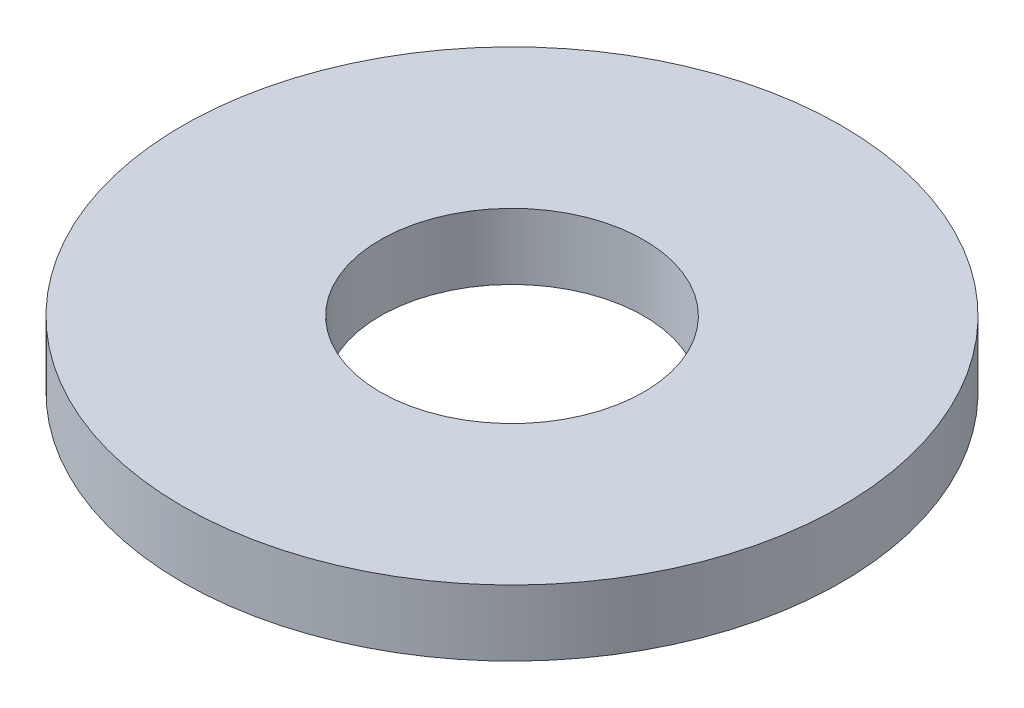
from build123d import *

# Parameters (mm, degrees)
SKETCH1_R           = 7.9375
SKETCH1_R_2         = 3.175
BOSS_EXTRUDE1_DEPTH = 1.5875


with BuildPart() as part:
    # Sketch1 → Boss-Extrude1 (new body)
    with BuildSketch(Plane(origin=(0, 0, 0), x_dir=(1, 0, 0), z_dir=(0, 1, 0))):
        with Locations(Location((0, 0, 0), (0, 0, 270))):
            Circle(SKETCH1_R)
        with Locations(Location((0, 0, 0), (0, 0, 270))):
            Circle(SKETCH1_R_2, mode=Mode.SUBTRACT)
    extrude(amount=BOSS_EXTRUDE1_DEPTH)


solid = part.part
